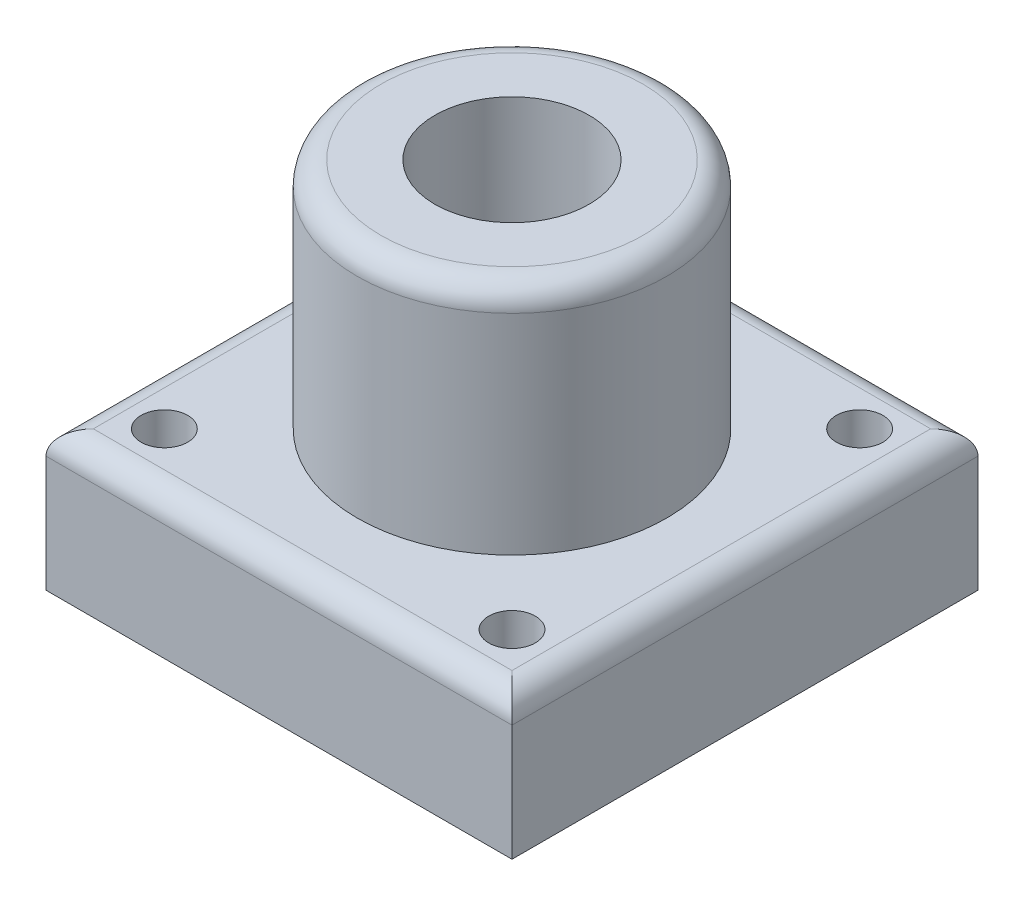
from build123d import *

# Parameters (mm, degrees)
SKETCH1_W           = 50
SKETCH1_H           = 50
BOSS_EXTRUDE1_DEPTH = 15
SKETCH3_R           = 16.6
BOSS_EXTRUDE2_DEPTH = 25
SKETCH4_R           = 2.5
CUT_EXTRUDE1_DEPTH  = 49.406213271
SKETCH5_R           = 8.28
CUT_EXTRUDE2_DEPTH  = 58.603484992
FILLET1_R           = 2.54


with BuildPart() as part:
    # Sketch1 → Boss-Extrude1 (new body)
    with BuildSketch(Plane(origin=(0, 0, 0), x_dir=(1, 0, 0), z_dir=(0, 1, 0))):
        with Locations((1.181102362, -7.135826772)):
            Rectangle(SKETCH1_W, SKETCH1_H)
    extrude(amount=BOSS_EXTRUDE1_DEPTH)

    # Sketch3 → Boss-Extrude2 (add)
    with BuildSketch(Plane(origin=(0, 15, 0), x_dir=(1, 0, 0), z_dir=(0, 1, 0))):
        with Locations(Location((1.1811024, -7.135826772, 0), (0, 0, 270))):
            Circle(SKETCH3_R)
    extrude(amount=BOSS_EXTRUDE2_DEPTH)

    # Sketch4 → Cut-Extrude1 (cut, through all)
    with BuildSketch(Plane(origin=(0, 15, 0), x_dir=(1, 0, 0), z_dir=(0, 1, 0))):
        with Locations(Location((-17.468897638, 11.514173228, 0), (0, 0, 270))):
            Circle(SKETCH4_R)
        with Locations(Location((19.831102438, 11.514173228, 0), (0, 0, 270))):
            Circle(SKETCH4_R)
        with Locations(Location((19.831102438, -25.785826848, 0), (0, 0, 270))):
            Circle(SKETCH4_R)
        with Locations(Location((-17.468897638, -25.785826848, 0), (0, 0, 270))):
            Circle(SKETCH4_R)
    extrude(amount=-CUT_EXTRUDE1_DEPTH, mode=Mode.SUBTRACT)

    # Sketch5 → Cut-Extrude2 (cut, through all)
    with BuildSketch(Plane(origin=(0, 40, 0), x_dir=(1, 0, 0), z_dir=(0, 1, 0))):
        with Locations(Location((1.1811024, -7.135826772, 0), (0, 0, 270))):
            Circle(SKETCH5_R)
    extrude(amount=-CUT_EXTRUDE2_DEPTH, mode=Mode.SUBTRACT)

    # Fillet1
    fillet1_edges = [part.edges().sort_by_distance(p)[0] for p in [
        (26.181102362, 15, 7.135826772),
        (1.1811024, 40, -9.464173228),
        (1.181102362, 15, -17.864173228),
        (-23.818897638, 15, 7.135826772),
        (1.181102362, 15, 32.135826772),
    ]]
    fillet(fillet1_edges, radius=FILLET1_R)


solid = part.part
